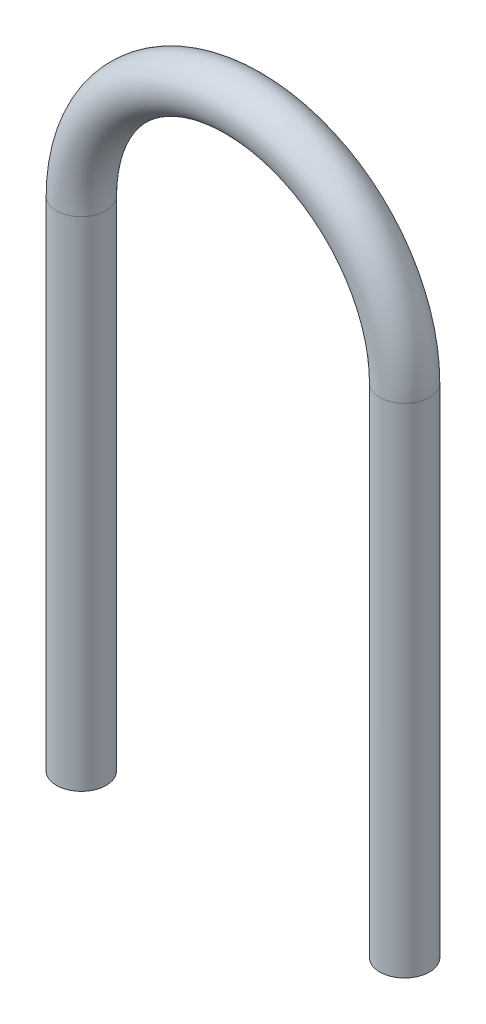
ISO-10303-21;
HEADER;
FILE_DESCRIPTION(('STEP AP214'),'2;1');
FILE_NAME('part.step','',(''),(''),'','','');
FILE_SCHEMA(('AUTOMOTIVE_DESIGN { 1 0 10303 214 1 1 1 1 }'));
ENDSEC;
DATA;
#1=APPLICATION_CONTEXT('core data for automotive mechanical design processes');
#2=APPLICATION_PROTOCOL_DEFINITION('international standard','automotive_design',2000,#1);
#3=PRODUCT_CONTEXT('',#1,'mechanical');
#4=PRODUCT('Part','Part','',(#3));
#5=PRODUCT_RELATED_PRODUCT_CATEGORY('part','',(#4));
#6=PRODUCT_DEFINITION_FORMATION('','',#4);
#7=PRODUCT_DEFINITION_CONTEXT('part definition',#1,'design');
#8=PRODUCT_DEFINITION('design','',#6,#7);
#9=PRODUCT_DEFINITION_SHAPE('','',#8);
#10=(LENGTH_UNIT() NAMED_UNIT(*) SI_UNIT(.MILLI.,.METRE.));
#11=(NAMED_UNIT(*) PLANE_ANGLE_UNIT() SI_UNIT($,.RADIAN.));
#12=(NAMED_UNIT(*) SI_UNIT($,.STERADIAN.) SOLID_ANGLE_UNIT());
#13=UNCERTAINTY_MEASURE_WITH_UNIT(LENGTH_MEASURE(1.E-05),#10,'distance_accuracy_value','');
#14=(GEOMETRIC_REPRESENTATION_CONTEXT(3) GLOBAL_UNCERTAINTY_ASSIGNED_CONTEXT((#13)) GLOBAL_UNIT_ASSIGNED_CONTEXT((#10,
#11,#12)) REPRESENTATION_CONTEXT('',''));
#15=CARTESIAN_POINT('',(0.,0.,0.));
#16=DIRECTION('',(0.,0.,1.));
#17=DIRECTION('',(1.,0.,0.));
#18=AXIS2_PLACEMENT_3D('',#15,#16,#17);
#19=CARTESIAN_POINT('',(20.6248,31.75,0.));
#20=DIRECTION('',(0.,-1.,0.));
#21=DIRECTION('',(0.,0.,-1.));
#22=AXIS2_PLACEMENT_3D('',#19,#20,#21);
#23=CYLINDRICAL_SURFACE('',#22,1.5875);
#24=CARTESIAN_POINT('',(20.6248,31.75,0.));
#25=DIRECTION('',(0.,-1.,0.));
#26=DIRECTION('',(0.,0.,1.));
#27=AXIS2_PLACEMENT_3D('',#24,#25,#26);
#28=CIRCLE('',#27,1.5875);
#29=CARTESIAN_POINT('',(22.2123,31.75,0.));
#30=VERTEX_POINT('',#29);
#31=EDGE_CURVE('E35',#30,#30,#28,.T.);
#32=ORIENTED_EDGE('',*,*,#31,.T.);
#33=EDGE_LOOP('',(#32));
#34=FACE_BOUND('',#33,.T.);
#35=CARTESIAN_POINT('',(20.6248,0.,0.));
#36=DIRECTION('',(0.,-1.,0.));
#37=DIRECTION('',(0.,0.,1.));
#38=AXIS2_PLACEMENT_3D('',#35,#36,#37);
#39=CIRCLE('',#38,1.5875);
#40=CARTESIAN_POINT('',(20.6248,0.,1.5875));
#41=VERTEX_POINT('',#40);
#42=EDGE_CURVE('E10',#41,#41,#39,.T.);
#43=ORIENTED_EDGE('',*,*,#42,.F.);
#44=EDGE_LOOP('',(#43));
#45=FACE_BOUND('',#44,.T.);
#46=ADVANCED_FACE('F29',(#34,#45),#23,.T.);
#47=CARTESIAN_POINT('',(10.3124,31.75,0.));
#48=DIRECTION('',(0.,0.,-1.));
#49=DIRECTION('',(-1.,0.,0.));
#50=AXIS2_PLACEMENT_3D('',#47,#48,#49);
#51=TOROIDAL_SURFACE('',#50,10.3124,1.5875);
#52=CARTESIAN_POINT('',(0.,31.75,0.));
#53=DIRECTION('',(0.,1.,0.));
#54=DIRECTION('',(0.,0.,1.));
#55=AXIS2_PLACEMENT_3D('',#52,#53,#54);
#56=CIRCLE('',#55,1.5875);
#57=CARTESIAN_POINT('',(-1.5875,31.75,0.));
#58=VERTEX_POINT('',#57);
#59=EDGE_CURVE('E39',#58,#58,#56,.T.);
#60=CARTESIAN_POINT('',(10.3124,31.75,0.));
#61=DIRECTION('',(0.,0.,-1.));
#62=DIRECTION('',(-1.,0.,0.));
#63=AXIS2_PLACEMENT_3D('',#60,#61,#62);
#64=CIRCLE('',#63,11.8999);
#65=EDGE_CURVE('',#58,#30,#64,.T.);
#66=ORIENTED_EDGE('',*,*,#59,.T.);
#67=ORIENTED_EDGE('',*,*,#31,.F.);
#68=ORIENTED_EDGE('',*,*,#65,.T.);
#69=ORIENTED_EDGE('',*,*,#65,.F.);
#70=EDGE_LOOP('',(#66,#68,#67,#69));
#71=FACE_BOUND('',#70,.T.);
#72=ADVANCED_FACE('F61',(#71),#51,.T.);
#73=CARTESIAN_POINT('',(0.,31.75,0.));
#74=DIRECTION('',(0.,-1.,0.));
#75=DIRECTION('',(0.,0.,-1.));
#76=AXIS2_PLACEMENT_3D('',#73,#74,#75);
#77=CYLINDRICAL_SURFACE('',#76,1.5875);
#78=ORIENTED_EDGE('',*,*,#59,.F.);
#79=EDGE_LOOP('',(#78));
#80=FACE_BOUND('',#79,.T.);
#81=CARTESIAN_POINT('',(0.,0.,0.));
#82=DIRECTION('',(0.,1.,0.));
#83=DIRECTION('',(0.,0.,1.));
#84=AXIS2_PLACEMENT_3D('',#81,#82,#83);
#85=CIRCLE('',#84,1.5875);
#86=CARTESIAN_POINT('',(0.,0.,1.5875));
#87=VERTEX_POINT('',#86);
#88=EDGE_CURVE('E43',#87,#87,#85,.T.);
#89=ORIENTED_EDGE('',*,*,#88,.T.);
#90=EDGE_LOOP('',(#89));
#91=FACE_BOUND('',#90,.T.);
#92=ADVANCED_FACE('F49',(#80,#91),#77,.T.);
#93=CARTESIAN_POINT('',(20.6248,0.,0.));
#94=DIRECTION('',(0.,-1.,0.));
#95=DIRECTION('',(0.,0.,1.));
#96=AXIS2_PLACEMENT_3D('',#93,#94,#95);
#97=PLANE('',#96);
#98=ORIENTED_EDGE('',*,*,#42,.T.);
#99=EDGE_LOOP('',(#98));
#100=FACE_BOUND('',#99,.T.);
#101=ADVANCED_FACE('F53',(#100),#97,.T.);
#102=CARTESIAN_POINT('',(0.,0.,0.));
#103=DIRECTION('',(0.,1.,0.));
#104=DIRECTION('',(0.,0.,1.));
#105=AXIS2_PLACEMENT_3D('',#102,#103,#104);
#106=PLANE('',#105);
#107=ORIENTED_EDGE('',*,*,#88,.F.);
#108=EDGE_LOOP('',(#107));
#109=FACE_BOUND('',#108,.T.);
#110=ADVANCED_FACE('F51',(#109),#106,.F.);
#111=CLOSED_SHELL('',(#46,#72,#92,#101,#110));
#112=MANIFOLD_SOLID_BREP('B2',#111);
#113=ADVANCED_BREP_SHAPE_REPRESENTATION('',(#18,#112),#14);
#114=SHAPE_DEFINITION_REPRESENTATION(#9,#113);
ENDSEC;
END-ISO-10303-21;
